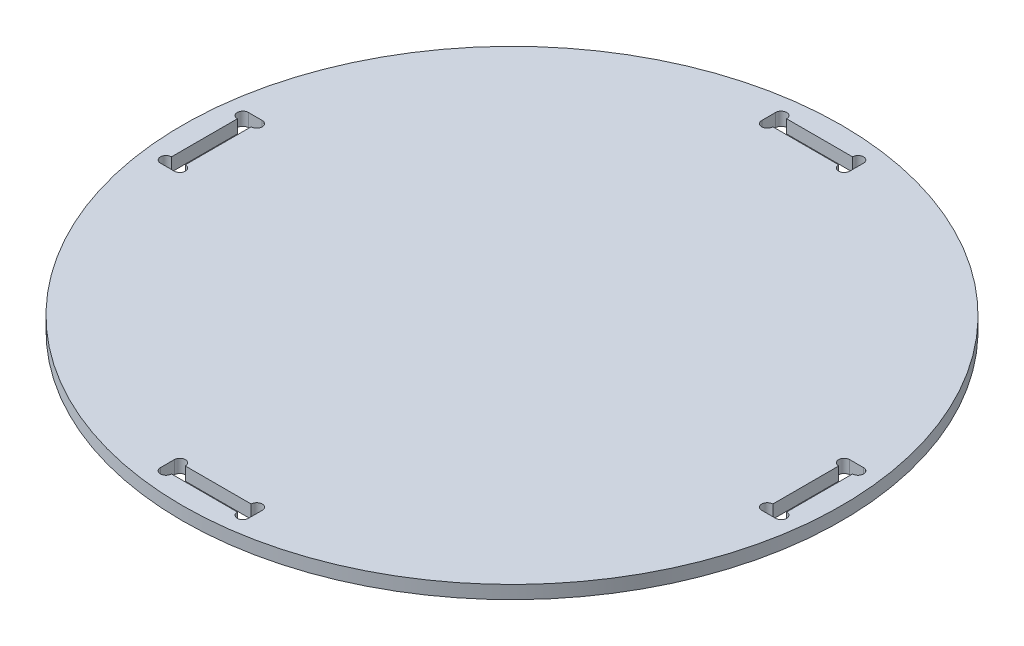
from build123d import *

# Parameters (mm, degrees)
SKETCH1_R           = 300
BOSS_EXTRUDE2_DEPTH = 12
CUT_EXTRUDE1_DEPTH  = 425.433740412


with BuildPart() as part:
    # Sketch1 → Boss-Extrude2 (new body)
    with BuildSketch(Plane(origin=(0, 0, 0), x_dir=(1, 0, 0), z_dir=(0, 1, 0))):
        with Locations(Location((0, 0, 0), (0, 0, 270))):
            Circle(SKETCH1_R)
    extrude(amount=BOSS_EXTRUDE2_DEPTH)

    # Sketch3 → Cut-Extrude1 (cut, through all)
    with BuildSketch(Plane(origin=(0, 12, 0), x_dir=(1, 0, 0), z_dir=(0, 1, 0))):
        with BuildLine():
            Line((-30, 280), (30, 280))
            ThreePointArc((30, 280), (34.999806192, 285.044023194), (39.999612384, 280))
            Line((39.999612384, 280), (39.999612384, 267.4))
            ThreePointArc((39.999612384, 267.4), (34.999806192, 262.355976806), (30, 267.4))
            Line((30, 267.4), (-30, 267.4))
            ThreePointArc((-30, 267.4), (-34.999806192, 262.355976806), (-39.999612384, 267.4))
            Line((-39.999612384, 267.4), (-39.999612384, 280))
            ThreePointArc((-39.999612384, 280), (-34.999806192, 285.044023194), (-30, 280))
        make_face()
        with BuildLine():
            Line((280, 39.999612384), (267.4, 39.999612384))
            ThreePointArc((267.4, 39.999612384), (262.355976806, 34.999806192), (267.4, 30))
            Line((267.4, 30), (267.4, -30))
            ThreePointArc((267.4, -30), (262.355976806, -34.999806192), (267.4, -39.999612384))
            Line((267.4, -39.999612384), (280, -39.999612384))
            ThreePointArc((280, -39.999612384), (285.044023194, -34.999806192), (280, -30))
            Line((280, -30), (280, 30))
            ThreePointArc((280, 30), (285.044023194, 34.999806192), (280, 39.999612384))
        make_face()
        with BuildLine():
            Line((39.999612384, -280), (39.999612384, -267.4))
            ThreePointArc((39.999612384, -267.4), (34.999806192, -262.355976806), (30, -267.4))
            Line((30, -267.4), (-30, -267.4))
            ThreePointArc((-30, -267.4), (-34.999806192, -262.355976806), (-39.999612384, -267.4))
            Line((-39.999612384, -267.4), (-39.999612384, -280))
            ThreePointArc((-39.999612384, -280), (-34.999806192, -285.044023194), (-30, -280))
            Line((-30, -280), (30, -280))
            ThreePointArc((30, -280), (34.999806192, -285.044023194), (39.999612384, -280))
        make_face()
        with BuildLine():
            Line((-280, -39.999612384), (-267.4, -39.999612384))
            ThreePointArc((-267.4, -39.999612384), (-262.355976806, -34.999806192), (-267.4, -30))
            Line((-267.4, -30), (-267.4, 30))
            ThreePointArc((-267.4, 30), (-262.355976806, 34.999806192), (-267.4, 39.999612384))
            Line((-267.4, 39.999612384), (-280, 39.999612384))
            ThreePointArc((-280, 39.999612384), (-285.044023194, 34.999806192), (-280, 30))
            Line((-280, 30), (-280, -30))
            ThreePointArc((-280, -30), (-285.044023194, -34.999806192), (-280, -39.999612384))
        make_face()
    extrude(amount=-CUT_EXTRUDE1_DEPTH, mode=Mode.SUBTRACT)


solid = part.part
